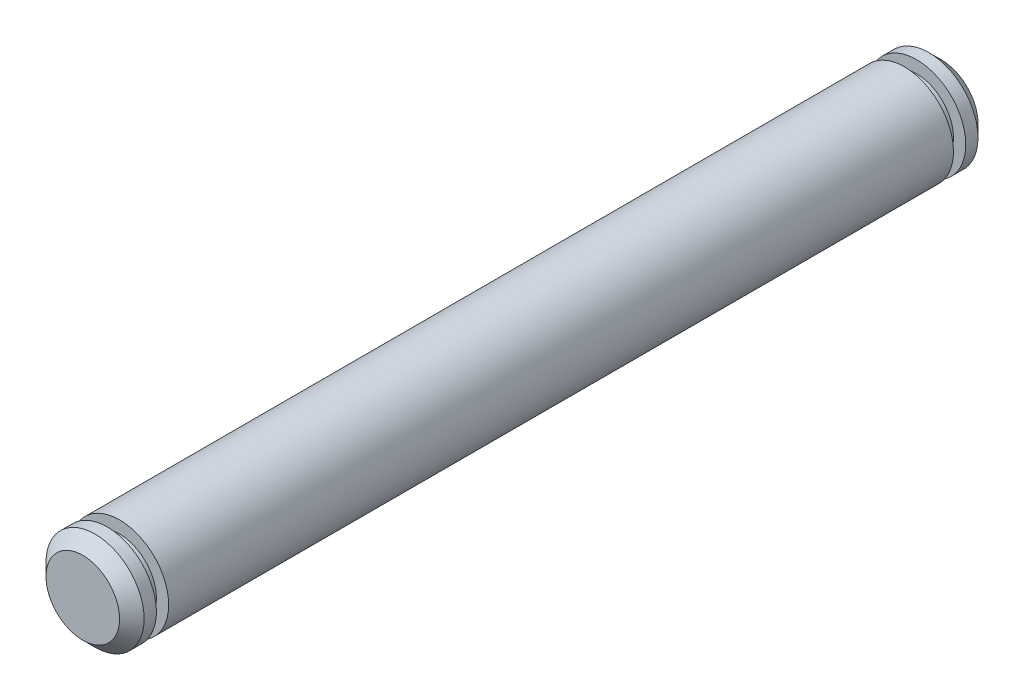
from build123d import *

# Parameters (mm, degrees)
ESQUISSE1_R          = 4
BASE_EXTRUSION_DEPTH = 70
ESQUISSE2_W          = 5
ESQUISSE2_H          = 1
ESQUISSE3_W          = 5
ESQUISSE3_H          = 1
CHANFREIN1_SIZE      = 1


with BuildPart() as part:
    # Esquisse1 → Base-Extrusion (new body)
    with BuildSketch(Plane.XY):
        with Locations(Location((0, 0, 0), (0, 0, 180))):
            Circle(ESQUISSE1_R)
    extrude(amount=BASE_EXTRUSION_DEPTH)

    # Esquisse2 → Enlever de la mati_re-Pivoter1 (revolve, cut)
    with BuildSketch(Plane(origin=(0, 0, 0), x_dir=(1, 0, 0), z_dir=(0, 1, 0))):
        with Locations((-5.5, -2.5)):
            Rectangle(ESQUISSE2_W, ESQUISSE2_H)
    revolve(axis=Axis((0, 0, -3.393664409), (0, 0, 1)), mode=Mode.SUBTRACT)

    # Esquisse3 → Enlever de la mati_re-Pivoter2 (revolve, cut)
    with BuildSketch(Plane(origin=(0, 0, 0), x_dir=(1, 0, 0), z_dir=(0, 1, 0))):
        with Locations((-5.5, -67.5)):
            Rectangle(ESQUISSE3_W, ESQUISSE3_H)
    revolve(axis=Axis((0, 0, -3.579328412), (0, 0, 1)), mode=Mode.SUBTRACT)

    # Chanfrein1
    chanfrein1_edges = [part.edges().sort_by_distance(p)[0] for p in [
        (4, 0, 0),
        (4, 0, 70),
    ]]
    chamfer(chanfrein1_edges, length=CHANFREIN1_SIZE)


solid = part.part
